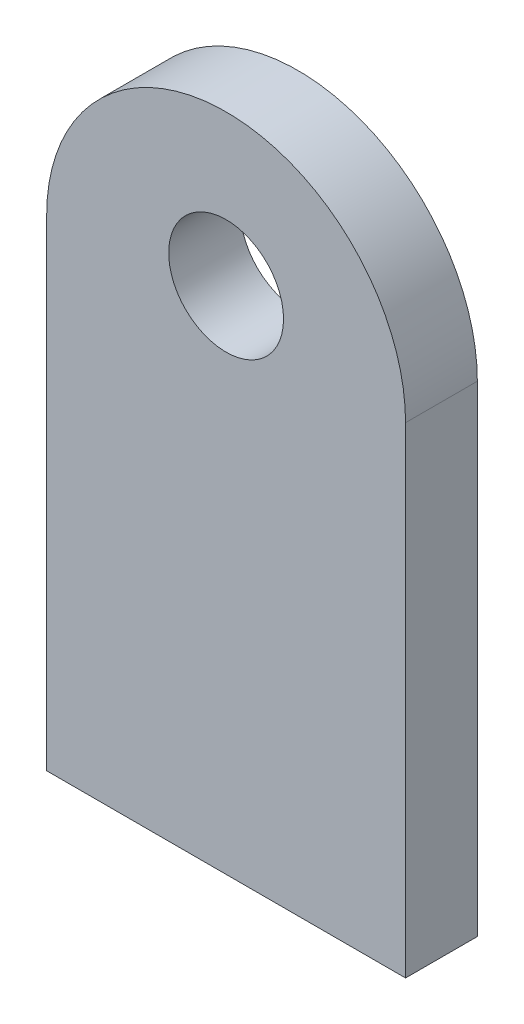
from build123d import *

# Parameters (mm, degrees)
BOSS_EXTRU_1_DEPTH            = 5
DIAM_TRE_DU_PER_AGE_8_0_8_1_D = 8


with BuildPart() as part:
    # Esquisse1 → Boss.-Extru.1 (new body)
    with BuildSketch(Plane.XY):
        with BuildLine():
            Line((-12.5, 0), (12.5, 0))
            Line((12.5, 0), (12.5, 33.5))
            ThreePointArc((12.5, 33.5), (0, 46), (-12.5, 33.5))
            Line((-12.5, 33.5), (-12.5, 0))
        make_face()
    extrude(amount=BOSS_EXTRU_1_DEPTH)

    # Diam_tre du per_age _8.0 _8_1 (through all)
    with Locations(Plane.XY.offset(5)):
        with Locations((0, 35.5)):
            Hole(DIAM_TRE_DU_PER_AGE_8_0_8_1_D / 2)


solid = part.part
